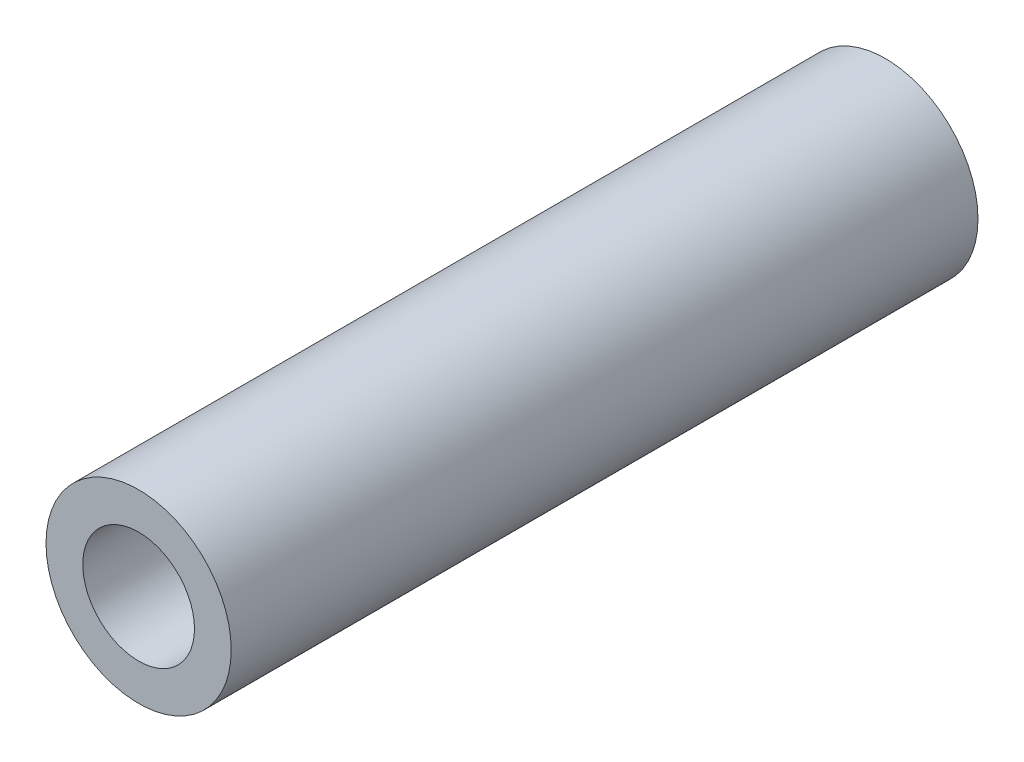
ISO-10303-21;
HEADER;
FILE_DESCRIPTION(('STEP AP214'),'2;1');
FILE_NAME('part.step','',(''),(''),'','','');
FILE_SCHEMA(('AUTOMOTIVE_DESIGN { 1 0 10303 214 1 1 1 1 }'));
ENDSEC;
DATA;
#1=APPLICATION_CONTEXT('core data for automotive mechanical design processes');
#2=APPLICATION_PROTOCOL_DEFINITION('international standard','automotive_design',2000,#1);
#3=PRODUCT_CONTEXT('',#1,'mechanical');
#4=PRODUCT('Part','Part','',(#3));
#5=PRODUCT_RELATED_PRODUCT_CATEGORY('part','',(#4));
#6=PRODUCT_DEFINITION_FORMATION('','',#4);
#7=PRODUCT_DEFINITION_CONTEXT('part definition',#1,'design');
#8=PRODUCT_DEFINITION('design','',#6,#7);
#9=PRODUCT_DEFINITION_SHAPE('','',#8);
#10=(LENGTH_UNIT() NAMED_UNIT(*) SI_UNIT(.MILLI.,.METRE.));
#11=(NAMED_UNIT(*) PLANE_ANGLE_UNIT() SI_UNIT($,.RADIAN.));
#12=(NAMED_UNIT(*) SI_UNIT($,.STERADIAN.) SOLID_ANGLE_UNIT());
#13=UNCERTAINTY_MEASURE_WITH_UNIT(LENGTH_MEASURE(1.E-05),#10,'distance_accuracy_value','');
#14=(GEOMETRIC_REPRESENTATION_CONTEXT(3) GLOBAL_UNCERTAINTY_ASSIGNED_CONTEXT((#13)) GLOBAL_UNIT_ASSIGNED_CONTEXT((#10,
#11,#12)) REPRESENTATION_CONTEXT('',''));
#15=CARTESIAN_POINT('',(0.,0.,0.));
#16=DIRECTION('',(0.,0.,1.));
#17=DIRECTION('',(1.,0.,0.));
#18=AXIS2_PLACEMENT_3D('',#15,#16,#17);
#19=CARTESIAN_POINT('',(0.,0.,254.));
#20=DIRECTION('',(0.,0.,1.));
#21=DIRECTION('',(1.,0.,0.));
#22=AXIS2_PLACEMENT_3D('',#19,#20,#21);
#23=PLANE('',#22);
#24=CARTESIAN_POINT('',(0.,0.,254.));
#25=DIRECTION('',(0.,0.,1.));
#26=DIRECTION('',(1.,0.,0.));
#27=AXIS2_PLACEMENT_3D('',#24,#25,#26);
#28=CIRCLE('',#27,31.5);
#29=CARTESIAN_POINT('',(31.5,0.,254.));
#30=VERTEX_POINT('',#29);
#31=EDGE_CURVE('E9',#30,#30,#28,.T.);
#32=ORIENTED_EDGE('',*,*,#31,.T.);
#33=EDGE_LOOP('',(#32));
#34=FACE_BOUND('',#33,.T.);
#35=CARTESIAN_POINT('',(0.,0.,254.));
#36=DIRECTION('',(0.,0.,1.));
#37=DIRECTION('',(1.,0.,0.));
#38=AXIS2_PLACEMENT_3D('',#35,#36,#37);
#39=CIRCLE('',#38,19.);
#40=CARTESIAN_POINT('',(19.,0.,254.));
#41=VERTEX_POINT('',#40);
#42=EDGE_CURVE('E25',#41,#41,#39,.T.);
#43=ORIENTED_EDGE('',*,*,#42,.F.);
#44=EDGE_LOOP('',(#43));
#45=FACE_BOUND('',#44,.T.);
#46=ADVANCED_FACE('F14',(#34,#45),#23,.T.);
#47=CARTESIAN_POINT('',(0.,0.,0.));
#48=DIRECTION('',(0.,0.,1.));
#49=DIRECTION('',(1.,0.,0.));
#50=AXIS2_PLACEMENT_3D('',#47,#48,#49);
#51=PLANE('',#50);
#52=CARTESIAN_POINT('',(0.,0.,0.));
#53=DIRECTION('',(0.,0.,1.));
#54=DIRECTION('',(1.,0.,0.));
#55=AXIS2_PLACEMENT_3D('',#52,#53,#54);
#56=CIRCLE('',#55,31.5);
#57=CARTESIAN_POINT('',(31.5,0.,0.));
#58=VERTEX_POINT('',#57);
#59=EDGE_CURVE('E18',#58,#58,#56,.T.);
#60=ORIENTED_EDGE('',*,*,#59,.F.);
#61=EDGE_LOOP('',(#60));
#62=FACE_BOUND('',#61,.T.);
#63=CARTESIAN_POINT('',(0.,0.,0.));
#64=DIRECTION('',(0.,0.,1.));
#65=DIRECTION('',(1.,0.,0.));
#66=AXIS2_PLACEMENT_3D('',#63,#64,#65);
#67=CIRCLE('',#66,19.);
#68=CARTESIAN_POINT('',(19.,0.,0.));
#69=VERTEX_POINT('',#68);
#70=EDGE_CURVE('E27',#69,#69,#67,.T.);
#71=ORIENTED_EDGE('',*,*,#70,.T.);
#72=EDGE_LOOP('',(#71));
#73=FACE_BOUND('',#72,.T.);
#74=ADVANCED_FACE('F37',(#62,#73),#51,.F.);
#75=CARTESIAN_POINT('',(0.,0.,254.));
#76=DIRECTION('',(0.,0.,-1.));
#77=DIRECTION('',(-1.,0.,0.));
#78=AXIS2_PLACEMENT_3D('',#75,#76,#77);
#79=CYLINDRICAL_SURFACE('',#78,31.5);
#80=ORIENTED_EDGE('',*,*,#31,.F.);
#81=EDGE_LOOP('',(#80));
#82=FACE_BOUND('',#81,.T.);
#83=ORIENTED_EDGE('',*,*,#59,.T.);
#84=EDGE_LOOP('',(#83));
#85=FACE_BOUND('',#84,.T.);
#86=ADVANCED_FACE('F16',(#82,#85),#79,.T.);
#87=CARTESIAN_POINT('',(0.,0.,254.));
#88=DIRECTION('',(0.,0.,-1.));
#89=DIRECTION('',(-1.,0.,0.));
#90=AXIS2_PLACEMENT_3D('',#87,#88,#89);
#91=CYLINDRICAL_SURFACE('',#90,19.);
#92=ORIENTED_EDGE('',*,*,#42,.T.);
#93=EDGE_LOOP('',(#92));
#94=FACE_BOUND('',#93,.T.);
#95=ORIENTED_EDGE('',*,*,#70,.F.);
#96=EDGE_LOOP('',(#95));
#97=FACE_BOUND('',#96,.T.);
#98=ADVANCED_FACE('F33',(#94,#97),#91,.F.);
#99=CLOSED_SHELL('',(#46,#74,#86,#98));
#100=MANIFOLD_SOLID_BREP('B1',#99);
#101=ADVANCED_BREP_SHAPE_REPRESENTATION('',(#18,#100),#14);
#102=SHAPE_DEFINITION_REPRESENTATION(#9,#101);
ENDSEC;
END-ISO-10303-21;
